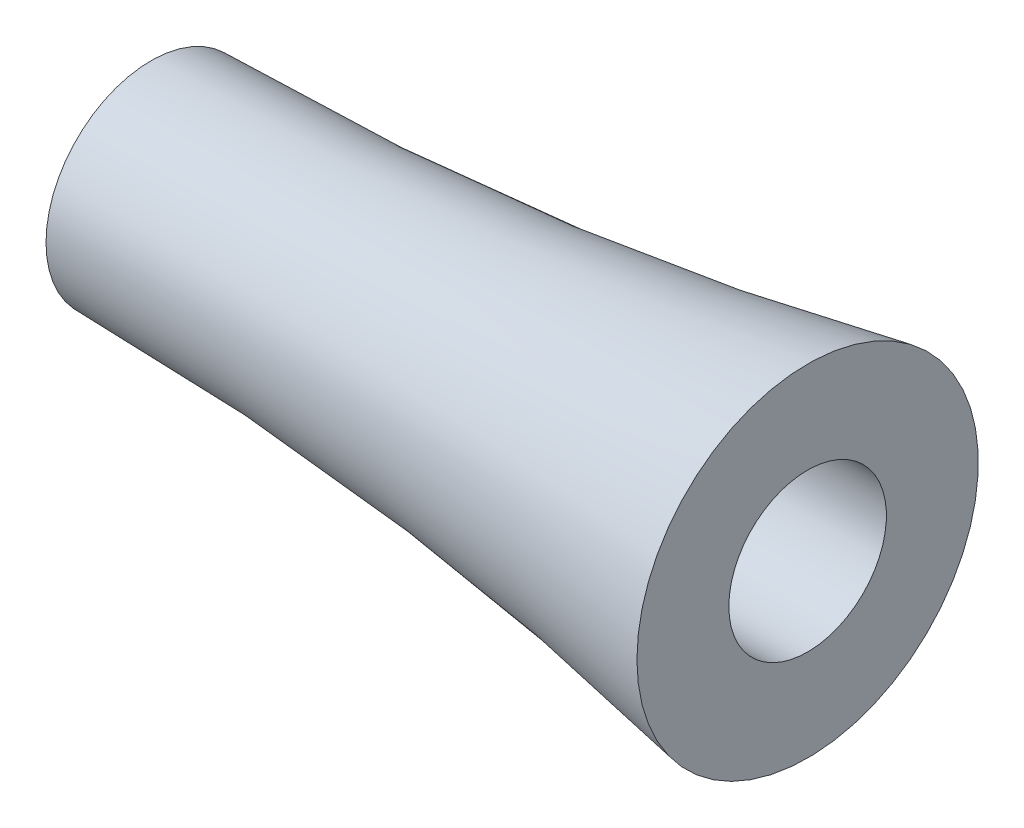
ISO-10303-21;
HEADER;
FILE_DESCRIPTION(('STEP AP214'),'2;1');
FILE_NAME('part.step','',(''),(''),'','','');
FILE_SCHEMA(('AUTOMOTIVE_DESIGN { 1 0 10303 214 1 1 1 1 }'));
ENDSEC;
DATA;
#1=APPLICATION_CONTEXT('core data for automotive mechanical design processes');
#2=APPLICATION_PROTOCOL_DEFINITION('international standard','automotive_design',2000,#1);
#3=PRODUCT_CONTEXT('',#1,'mechanical');
#4=PRODUCT('Part','Part','',(#3));
#5=PRODUCT_RELATED_PRODUCT_CATEGORY('part','',(#4));
#6=PRODUCT_DEFINITION_FORMATION('','',#4);
#7=PRODUCT_DEFINITION_CONTEXT('part definition',#1,'design');
#8=PRODUCT_DEFINITION('design','',#6,#7);
#9=PRODUCT_DEFINITION_SHAPE('','',#8);
#10=(LENGTH_UNIT() NAMED_UNIT(*) SI_UNIT(.MILLI.,.METRE.));
#11=(NAMED_UNIT(*) PLANE_ANGLE_UNIT() SI_UNIT($,.RADIAN.));
#12=(NAMED_UNIT(*) SI_UNIT($,.STERADIAN.) SOLID_ANGLE_UNIT());
#13=UNCERTAINTY_MEASURE_WITH_UNIT(LENGTH_MEASURE(1.E-05),#10,'distance_accuracy_value','');
#14=(GEOMETRIC_REPRESENTATION_CONTEXT(3) GLOBAL_UNCERTAINTY_ASSIGNED_CONTEXT((#13)) GLOBAL_UNIT_ASSIGNED_CONTEXT((#10,
#11,#12)) REPRESENTATION_CONTEXT('',''));
#15=CARTESIAN_POINT('',(0.,0.,0.));
#16=DIRECTION('',(0.,0.,1.));
#17=DIRECTION('',(1.,0.,0.));
#18=AXIS2_PLACEMENT_3D('',#15,#16,#17);
#19=CARTESIAN_POINT('',(-18.3710691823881,-3.,0.));
#20=DIRECTION('',(-1.,0.,0.));
#21=DIRECTION('',(0.,0.,1.));
#22=AXIS2_PLACEMENT_3D('',#19,#20,#21);
#23=TOROIDAL_SURFACE('',#22,130.249999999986,126.249999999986);
#24=CARTESIAN_POINT('',(6.6289308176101,-3.,0.));
#25=DIRECTION('',(-1.,0.,0.));
#26=DIRECTION('',(0.,0.,1.));
#27=AXIS2_PLACEMENT_3D('',#24,#25,#26);
#28=CIRCLE('',#27,6.5);
#29=CARTESIAN_POINT('',(6.6289308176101,-3.,6.5));
#30=VERTEX_POINT('',#29);
#31=EDGE_CURVE('E47',#30,#30,#28,.T.);
#32=ORIENTED_EDGE('',*,*,#31,.T.);
#33=EDGE_LOOP('',(#32));
#34=FACE_BOUND('',#33,.T.);
#35=CARTESIAN_POINT('',(-18.3710691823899,-3.,0.));
#36=DIRECTION('',(-1.,0.,0.));
#37=DIRECTION('',(0.,0.,1.));
#38=AXIS2_PLACEMENT_3D('',#35,#36,#37);
#39=CIRCLE('',#38,4.);
#40=CARTESIAN_POINT('',(-18.3710691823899,-3.,4.));
#41=VERTEX_POINT('',#40);
#42=EDGE_CURVE('E10',#41,#41,#39,.T.);
#43=ORIENTED_EDGE('',*,*,#42,.F.);
#44=EDGE_LOOP('',(#43));
#45=FACE_BOUND('',#44,.T.);
#46=ADVANCED_FACE('F33',(#34,#45),#23,.F.);
#47=CARTESIAN_POINT('',(-18.3710691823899,2.54949799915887E-13,0.));
#48=DIRECTION('',(-1.,0.,0.));
#49=DIRECTION('',(0.,0.,1.));
#50=AXIS2_PLACEMENT_3D('',#47,#48,#49);
#51=PLANE('',#50);
#52=ORIENTED_EDGE('',*,*,#42,.T.);
#53=EDGE_LOOP('',(#52));
#54=FACE_BOUND('',#53,.T.);
#55=CARTESIAN_POINT('',(-18.3710691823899,-3.,0.));
#56=DIRECTION('',(-1.,0.,0.));
#57=DIRECTION('',(0.,0.,1.));
#58=AXIS2_PLACEMENT_3D('',#55,#56,#57);
#59=CIRCLE('',#58,3.);
#60=CARTESIAN_POINT('',(-18.3710691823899,-3.,3.));
#61=VERTEX_POINT('',#60);
#62=EDGE_CURVE('E39',#61,#61,#59,.T.);
#63=ORIENTED_EDGE('',*,*,#62,.F.);
#64=EDGE_LOOP('',(#63));
#65=FACE_BOUND('',#64,.T.);
#66=ADVANCED_FACE('F63',(#54,#65),#51,.T.);
#67=CARTESIAN_POINT('',(-18.3710691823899,-3.,0.));
#68=DIRECTION('',(-1.,0.,0.));
#69=DIRECTION('',(0.,0.,1.));
#70=AXIS2_PLACEMENT_3D('',#67,#68,#69);
#71=CYLINDRICAL_SURFACE('',#70,3.);
#72=CARTESIAN_POINT('',(6.62893081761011,-3.,0.));
#73=DIRECTION('',(-1.,0.,0.));
#74=DIRECTION('',(0.,0.,1.));
#75=AXIS2_PLACEMENT_3D('',#72,#73,#74);
#76=CIRCLE('',#75,3.);
#77=CARTESIAN_POINT('',(6.62893081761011,-3.,3.));
#78=VERTEX_POINT('',#77);
#79=EDGE_CURVE('E43',#78,#78,#76,.T.);
#80=ORIENTED_EDGE('',*,*,#79,.F.);
#81=EDGE_LOOP('',(#80));
#82=FACE_BOUND('',#81,.T.);
#83=ORIENTED_EDGE('',*,*,#62,.T.);
#84=EDGE_LOOP('',(#83));
#85=FACE_BOUND('',#84,.T.);
#86=ADVANCED_FACE('F58',(#82,#85),#71,.F.);
#87=CARTESIAN_POINT('',(6.62893081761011,0.,0.));
#88=DIRECTION('',(-1.,0.,0.));
#89=DIRECTION('',(0.,0.,1.));
#90=AXIS2_PLACEMENT_3D('',#87,#88,#89);
#91=PLANE('',#90);
#92=ORIENTED_EDGE('',*,*,#31,.F.);
#93=EDGE_LOOP('',(#92));
#94=FACE_BOUND('',#93,.T.);
#95=ORIENTED_EDGE('',*,*,#79,.T.);
#96=EDGE_LOOP('',(#95));
#97=FACE_BOUND('',#96,.T.);
#98=ADVANCED_FACE('F55',(#94,#97),#91,.F.);
#99=CLOSED_SHELL('',(#46,#66,#86,#98));
#100=MANIFOLD_SOLID_BREP('B2',#99);
#101=ADVANCED_BREP_SHAPE_REPRESENTATION('',(#18,#100),#14);
#102=SHAPE_DEFINITION_REPRESENTATION(#9,#101);
ENDSEC;
END-ISO-10303-21;
